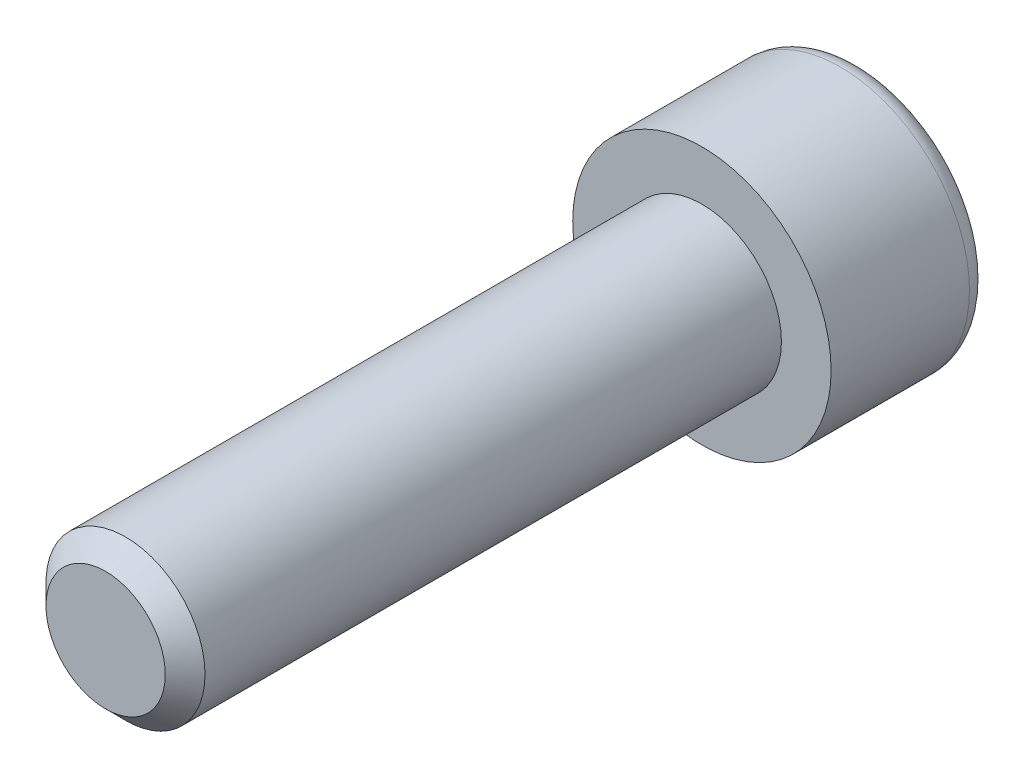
ISO-10303-21;
HEADER;
FILE_DESCRIPTION(('STEP AP214'),'2;1');
FILE_NAME('part.step','',(''),(''),'','','');
FILE_SCHEMA(('AUTOMOTIVE_DESIGN { 1 0 10303 214 1 1 1 1 }'));
ENDSEC;
DATA;
#1=APPLICATION_CONTEXT('core data for automotive mechanical design processes');
#2=APPLICATION_PROTOCOL_DEFINITION('international standard','automotive_design',2000,#1);
#3=PRODUCT_CONTEXT('',#1,'mechanical');
#4=PRODUCT('Part','Part','',(#3));
#5=PRODUCT_RELATED_PRODUCT_CATEGORY('part','',(#4));
#6=PRODUCT_DEFINITION_FORMATION('','',#4);
#7=PRODUCT_DEFINITION_CONTEXT('part definition',#1,'design');
#8=PRODUCT_DEFINITION('design','',#6,#7);
#9=PRODUCT_DEFINITION_SHAPE('','',#8);
#10=(LENGTH_UNIT() NAMED_UNIT(*) SI_UNIT(.MILLI.,.METRE.));
#11=(NAMED_UNIT(*) PLANE_ANGLE_UNIT() SI_UNIT($,.RADIAN.));
#12=(NAMED_UNIT(*) SI_UNIT($,.STERADIAN.) SOLID_ANGLE_UNIT());
#13=UNCERTAINTY_MEASURE_WITH_UNIT(LENGTH_MEASURE(1.E-05),#10,'distance_accuracy_value','');
#14=(GEOMETRIC_REPRESENTATION_CONTEXT(3) GLOBAL_UNCERTAINTY_ASSIGNED_CONTEXT((#13)) GLOBAL_UNIT_ASSIGNED_CONTEXT((#10,
#11,#12)) REPRESENTATION_CONTEXT('',''));
#15=CARTESIAN_POINT('',(0.,0.,0.));
#16=DIRECTION('',(0.,0.,1.));
#17=DIRECTION('',(1.,0.,0.));
#18=AXIS2_PLACEMENT_3D('',#15,#16,#17);
#19=CARTESIAN_POINT('',(0.,0.,-8.));
#20=DIRECTION('',(0.,0.,1.));
#21=DIRECTION('',(1.,0.,0.));
#22=AXIS2_PLACEMENT_3D('',#19,#20,#21);
#23=PLANE('',#22);
#24=CARTESIAN_POINT('',(0.,0.,-8.));
#25=DIRECTION('',(0.,0.,1.));
#26=DIRECTION('',(1.,0.,0.));
#27=AXIS2_PLACEMENT_3D('',#24,#25,#26);
#28=CIRCLE('',#27,5.46);
#29=CARTESIAN_POINT('',(5.46,0.,-8.));
#30=VERTEX_POINT('',#29);
#31=EDGE_CURVE('E11',#30,#30,#28,.F.);
#32=ORIENTED_EDGE('',*,*,#31,.T.);
#33=EDGE_LOOP('',(#32));
#34=FACE_BOUND('',#33,.T.);
#35=DIRECTION('',(0.866025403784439,-0.5,0.));
#36=VECTOR('',#35,1.);
#37=CARTESIAN_POINT('',(-3.,-1.73205080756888,-8.));
#38=LINE('',#37,#36);
#39=CARTESIAN_POINT('',(-3.,-1.73205080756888,-8.));
#40=VERTEX_POINT('',#39);
#41=CARTESIAN_POINT('',(0.,-3.46410161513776,-8.));
#42=VERTEX_POINT('',#41);
#43=EDGE_CURVE('E54',#40,#42,#38,.T.);
#44=ORIENTED_EDGE('',*,*,#43,.T.);
#45=DIRECTION('',(0.866025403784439,0.5,0.));
#46=VECTOR('',#45,1.);
#47=CARTESIAN_POINT('',(0.,-3.46410161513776,-8.));
#48=LINE('',#47,#46);
#49=CARTESIAN_POINT('',(3.,-1.73205080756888,-8.));
#50=VERTEX_POINT('',#49);
#51=EDGE_CURVE('E125',#42,#50,#48,.T.);
#52=ORIENTED_EDGE('',*,*,#51,.T.);
#53=DIRECTION('',(0.,1.,0.));
#54=VECTOR('',#53,1.);
#55=CARTESIAN_POINT('',(3.,-1.73205080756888,-8.));
#56=LINE('',#55,#54);
#57=CARTESIAN_POINT('',(3.,1.73205080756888,-8.));
#58=VERTEX_POINT('',#57);
#59=EDGE_CURVE('E128',#50,#58,#56,.T.);
#60=ORIENTED_EDGE('',*,*,#59,.T.);
#61=DIRECTION('',(-0.866025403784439,0.5,0.));
#62=VECTOR('',#61,1.);
#63=CARTESIAN_POINT('',(3.,1.73205080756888,-8.));
#64=LINE('',#63,#62);
#65=CARTESIAN_POINT('',(0.,3.46410161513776,-8.));
#66=VERTEX_POINT('',#65);
#67=EDGE_CURVE('E131',#58,#66,#64,.T.);
#68=ORIENTED_EDGE('',*,*,#67,.T.);
#69=DIRECTION('',(-0.866025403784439,-0.5,0.));
#70=VECTOR('',#69,1.);
#71=CARTESIAN_POINT('',(0.,3.46410161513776,-8.));
#72=LINE('',#71,#70);
#73=CARTESIAN_POINT('',(-3.,1.73205080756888,-8.));
#74=VERTEX_POINT('',#73);
#75=EDGE_CURVE('E115',#66,#74,#72,.T.);
#76=ORIENTED_EDGE('',*,*,#75,.T.);
#77=DIRECTION('',(0.,-1.,0.));
#78=VECTOR('',#77,1.);
#79=CARTESIAN_POINT('',(-3.,1.73205080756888,-8.));
#80=LINE('',#79,#78);
#81=EDGE_CURVE('E134',#74,#40,#80,.T.);
#82=ORIENTED_EDGE('',*,*,#81,.T.);
#83=EDGE_LOOP('',(#44,#52,#60,#68,#76,#82));
#84=FACE_BOUND('',#83,.T.);
#85=ADVANCED_FACE('F39',(#34,#84),#23,.F.);
#86=CARTESIAN_POINT('',(0.,0.,30.));
#87=DIRECTION('',(0.,0.,-1.));
#88=DIRECTION('',(-1.,0.,0.));
#89=AXIS2_PLACEMENT_3D('',#86,#87,#88);
#90=CYLINDRICAL_SURFACE('',#89,4.);
#91=CARTESIAN_POINT('',(0.,0.,29.));
#92=DIRECTION('',(0.,0.,1.));
#93=DIRECTION('',(1.,0.,0.));
#94=AXIS2_PLACEMENT_3D('',#91,#92,#93);
#95=CIRCLE('',#94,4.);
#96=CARTESIAN_POINT('',(4.,0.,29.));
#97=VERTEX_POINT('',#96);
#98=EDGE_CURVE('E154',#97,#97,#95,.F.);
#99=ORIENTED_EDGE('',*,*,#98,.T.);
#100=EDGE_LOOP('',(#99));
#101=FACE_BOUND('',#100,.T.);
#102=CARTESIAN_POINT('',(0.,0.,0.));
#103=DIRECTION('',(0.,0.,1.));
#104=DIRECTION('',(1.,0.,0.));
#105=AXIS2_PLACEMENT_3D('',#102,#103,#104);
#106=CIRCLE('',#105,4.);
#107=CARTESIAN_POINT('',(4.,0.,0.));
#108=VERTEX_POINT('',#107);
#109=EDGE_CURVE('E148',#108,#108,#106,.T.);
#110=ORIENTED_EDGE('',*,*,#109,.T.);
#111=EDGE_LOOP('',(#110));
#112=FACE_BOUND('',#111,.T.);
#113=ADVANCED_FACE('F171',(#101,#112),#90,.T.);
#114=CARTESIAN_POINT('',(0.,0.,30.));
#115=DIRECTION('',(0.,0.,1.));
#116=DIRECTION('',(1.,0.,0.));
#117=AXIS2_PLACEMENT_3D('',#114,#115,#116);
#118=PLANE('',#117);
#119=CARTESIAN_POINT('',(0.,0.,30.));
#120=DIRECTION('',(0.,0.,1.));
#121=DIRECTION('',(1.,0.,0.));
#122=AXIS2_PLACEMENT_3D('',#119,#120,#121);
#123=CIRCLE('',#122,3.);
#124=CARTESIAN_POINT('',(3.,0.,30.));
#125=VERTEX_POINT('',#124);
#126=EDGE_CURVE('E151',#125,#125,#123,.T.);
#127=ORIENTED_EDGE('',*,*,#126,.T.);
#128=EDGE_LOOP('',(#127));
#129=FACE_BOUND('',#128,.T.);
#130=ADVANCED_FACE('F177',(#129),#118,.T.);
#131=CARTESIAN_POINT('',(0.,0.,0.));
#132=DIRECTION('',(0.,0.,1.));
#133=DIRECTION('',(1.,0.,0.));
#134=AXIS2_PLACEMENT_3D('',#131,#132,#133);
#135=PLANE('',#134);
#136=CARTESIAN_POINT('',(0.,0.,0.));
#137=DIRECTION('',(0.,0.,1.));
#138=DIRECTION('',(1.,0.,0.));
#139=AXIS2_PLACEMENT_3D('',#136,#137,#138);
#140=CIRCLE('',#139,6.5);
#141=CARTESIAN_POINT('',(6.5,0.,0.));
#142=VERTEX_POINT('',#141);
#143=EDGE_CURVE('E145',#142,#142,#140,.T.);
#144=ORIENTED_EDGE('',*,*,#143,.T.);
#145=EDGE_LOOP('',(#144));
#146=FACE_BOUND('',#145,.T.);
#147=ORIENTED_EDGE('',*,*,#109,.F.);
#148=EDGE_LOOP('',(#147));
#149=FACE_BOUND('',#148,.T.);
#150=ADVANCED_FACE('F185',(#146,#149),#135,.T.);
#151=CARTESIAN_POINT('',(0.,0.,-8.));
#152=DIRECTION('',(0.,0.,1.));
#153=DIRECTION('',(1.,0.,0.));
#154=AXIS2_PLACEMENT_3D('',#151,#152,#153);
#155=CYLINDRICAL_SURFACE('',#154,6.5);
#156=CARTESIAN_POINT('',(0.,0.,-6.96));
#157=DIRECTION('',(0.,0.,1.));
#158=DIRECTION('',(1.,0.,0.));
#159=AXIS2_PLACEMENT_3D('',#156,#157,#158);
#160=CIRCLE('',#159,6.5);
#161=CARTESIAN_POINT('',(6.5,0.,-6.96));
#162=VERTEX_POINT('',#161);
#163=EDGE_CURVE('E47',#162,#162,#160,.T.);
#164=ORIENTED_EDGE('',*,*,#163,.T.);
#165=EDGE_LOOP('',(#164));
#166=FACE_BOUND('',#165,.T.);
#167=ORIENTED_EDGE('',*,*,#143,.F.);
#168=EDGE_LOOP('',(#167));
#169=FACE_BOUND('',#168,.T.);
#170=ADVANCED_FACE('F159',(#166,#169),#155,.T.);
#171=CARTESIAN_POINT('',(-3.,-1.73205080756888,-2.4));
#172=DIRECTION('',(0.5,0.866025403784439,0.));
#173=DIRECTION('',(-0.866025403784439,0.5,0.));
#174=AXIS2_PLACEMENT_3D('',#171,#172,#173);
#175=PLANE('',#174);
#176=ORIENTED_EDGE('',*,*,#43,.F.);
#177=DIRECTION('',(0.,0.,-1.));
#178=VECTOR('',#177,1.);
#179=CARTESIAN_POINT('',(-3.,-1.73205080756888,-2.4));
#180=LINE('',#179,#178);
#181=CARTESIAN_POINT('',(-3.,-1.73205080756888,-2.4));
#182=VERTEX_POINT('',#181);
#183=EDGE_CURVE('E120',#182,#40,#180,.T.);
#184=ORIENTED_EDGE('',*,*,#183,.F.);
#185=DIRECTION('',(0.866025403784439,-0.5,0.));
#186=VECTOR('',#185,1.);
#187=CARTESIAN_POINT('',(-3.,-1.73205080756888,-2.4));
#188=LINE('',#187,#186);
#189=CARTESIAN_POINT('',(0.,-3.46410161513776,-2.4));
#190=VERTEX_POINT('',#189);
#191=EDGE_CURVE('E137',#182,#190,#188,.T.);
#192=ORIENTED_EDGE('',*,*,#191,.T.);
#193=DIRECTION('',(0.,0.,-1.));
#194=VECTOR('',#193,1.);
#195=CARTESIAN_POINT('',(0.,-3.46410161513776,-2.4));
#196=LINE('',#195,#194);
#197=EDGE_CURVE('E143',#190,#42,#196,.T.);
#198=ORIENTED_EDGE('',*,*,#197,.T.);
#199=EDGE_LOOP('',(#176,#184,#192,#198));
#200=FACE_BOUND('',#199,.T.);
#201=ADVANCED_FACE('F183',(#200),#175,.T.);
#202=CARTESIAN_POINT('',(0.,-3.46410161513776,-2.4));
#203=DIRECTION('',(-0.5,0.866025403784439,0.));
#204=DIRECTION('',(-0.866025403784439,-0.5,0.));
#205=AXIS2_PLACEMENT_3D('',#202,#203,#204);
#206=PLANE('',#205);
#207=ORIENTED_EDGE('',*,*,#51,.F.);
#208=ORIENTED_EDGE('',*,*,#197,.F.);
#209=DIRECTION('',(0.866025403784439,0.5,0.));
#210=VECTOR('',#209,1.);
#211=CARTESIAN_POINT('',(0.,-3.46410161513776,-2.4));
#212=LINE('',#211,#210);
#213=CARTESIAN_POINT('',(3.,-1.73205080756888,-2.4));
#214=VERTEX_POINT('',#213);
#215=EDGE_CURVE('E93',#190,#214,#212,.T.);
#216=ORIENTED_EDGE('',*,*,#215,.T.);
#217=DIRECTION('',(0.,0.,-1.));
#218=VECTOR('',#217,1.);
#219=CARTESIAN_POINT('',(3.,-1.73205080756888,-2.4));
#220=LINE('',#219,#218);
#221=EDGE_CURVE('E141',#214,#50,#220,.T.);
#222=ORIENTED_EDGE('',*,*,#221,.T.);
#223=EDGE_LOOP('',(#207,#208,#216,#222));
#224=FACE_BOUND('',#223,.T.);
#225=ADVANCED_FACE('F215',(#224),#206,.T.);
#226=CARTESIAN_POINT('',(3.,-1.73205080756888,-2.4));
#227=DIRECTION('',(-1.,0.,0.));
#228=DIRECTION('',(0.,-1.,0.));
#229=AXIS2_PLACEMENT_3D('',#226,#227,#228);
#230=PLANE('',#229);
#231=ORIENTED_EDGE('',*,*,#59,.F.);
#232=ORIENTED_EDGE('',*,*,#221,.F.);
#233=DIRECTION('',(0.,1.,0.));
#234=VECTOR('',#233,1.);
#235=CARTESIAN_POINT('',(3.,-1.73205080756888,-2.4));
#236=LINE('',#235,#234);
#237=CARTESIAN_POINT('',(3.,1.73205080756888,-2.4));
#238=VERTEX_POINT('',#237);
#239=EDGE_CURVE('E111',#214,#238,#236,.T.);
#240=ORIENTED_EDGE('',*,*,#239,.T.);
#241=DIRECTION('',(0.,0.,-1.));
#242=VECTOR('',#241,1.);
#243=CARTESIAN_POINT('',(3.,1.73205080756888,-2.4));
#244=LINE('',#243,#242);
#245=EDGE_CURVE('E108',#238,#58,#244,.T.);
#246=ORIENTED_EDGE('',*,*,#245,.T.);
#247=EDGE_LOOP('',(#231,#232,#240,#246));
#248=FACE_BOUND('',#247,.T.);
#249=ADVANCED_FACE('F221',(#248),#230,.T.);
#250=CARTESIAN_POINT('',(3.,1.73205080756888,-2.4));
#251=DIRECTION('',(-0.5,-0.866025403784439,0.));
#252=DIRECTION('',(0.866025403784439,-0.5,0.));
#253=AXIS2_PLACEMENT_3D('',#250,#251,#252);
#254=PLANE('',#253);
#255=ORIENTED_EDGE('',*,*,#67,.F.);
#256=ORIENTED_EDGE('',*,*,#245,.F.);
#257=DIRECTION('',(-0.866025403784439,0.5,0.));
#258=VECTOR('',#257,1.);
#259=CARTESIAN_POINT('',(3.,1.73205080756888,-2.4));
#260=LINE('',#259,#258);
#261=CARTESIAN_POINT('',(0.,3.46410161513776,-2.4));
#262=VERTEX_POINT('',#261);
#263=EDGE_CURVE('E103',#238,#262,#260,.T.);
#264=ORIENTED_EDGE('',*,*,#263,.T.);
#265=DIRECTION('',(0.,0.,-1.));
#266=VECTOR('',#265,1.);
#267=CARTESIAN_POINT('',(0.,3.46410161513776,-2.4));
#268=LINE('',#267,#266);
#269=EDGE_CURVE('E107',#262,#66,#268,.T.);
#270=ORIENTED_EDGE('',*,*,#269,.T.);
#271=EDGE_LOOP('',(#255,#256,#264,#270));
#272=FACE_BOUND('',#271,.T.);
#273=ADVANCED_FACE('F106',(#272),#254,.T.);
#274=CARTESIAN_POINT('',(0.,3.46410161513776,-2.4));
#275=DIRECTION('',(0.5,-0.866025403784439,0.));
#276=DIRECTION('',(0.866025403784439,0.5,0.));
#277=AXIS2_PLACEMENT_3D('',#274,#275,#276);
#278=PLANE('',#277);
#279=ORIENTED_EDGE('',*,*,#75,.F.);
#280=ORIENTED_EDGE('',*,*,#269,.F.);
#281=DIRECTION('',(-0.866025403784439,-0.5,0.));
#282=VECTOR('',#281,1.);
#283=CARTESIAN_POINT('',(0.,3.46410161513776,-2.4));
#284=LINE('',#283,#282);
#285=CARTESIAN_POINT('',(-3.,1.73205080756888,-2.4));
#286=VERTEX_POINT('',#285);
#287=EDGE_CURVE('E110',#262,#286,#284,.T.);
#288=ORIENTED_EDGE('',*,*,#287,.T.);
#289=DIRECTION('',(0.,0.,-1.));
#290=VECTOR('',#289,1.);
#291=CARTESIAN_POINT('',(-3.,1.73205080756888,-2.4));
#292=LINE('',#291,#290);
#293=EDGE_CURVE('E84',#286,#74,#292,.T.);
#294=ORIENTED_EDGE('',*,*,#293,.T.);
#295=EDGE_LOOP('',(#279,#280,#288,#294));
#296=FACE_BOUND('',#295,.T.);
#297=ADVANCED_FACE('F113',(#296),#278,.T.);
#298=CARTESIAN_POINT('',(-3.,1.73205080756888,-2.4));
#299=DIRECTION('',(1.,0.,0.));
#300=DIRECTION('',(0.,1.,0.));
#301=AXIS2_PLACEMENT_3D('',#298,#299,#300);
#302=PLANE('',#301);
#303=ORIENTED_EDGE('',*,*,#81,.F.);
#304=ORIENTED_EDGE('',*,*,#293,.F.);
#305=DIRECTION('',(0.,-1.,0.));
#306=VECTOR('',#305,1.);
#307=CARTESIAN_POINT('',(-3.,1.73205080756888,-2.4));
#308=LINE('',#307,#306);
#309=EDGE_CURVE('E62',#286,#182,#308,.T.);
#310=ORIENTED_EDGE('',*,*,#309,.T.);
#311=ORIENTED_EDGE('',*,*,#183,.T.);
#312=EDGE_LOOP('',(#303,#304,#310,#311));
#313=FACE_BOUND('',#312,.T.);
#314=ADVANCED_FACE('F241',(#313),#302,.T.);
#315=CARTESIAN_POINT('',(-6.,0.,-2.4));
#316=DIRECTION('',(0.,0.,-1.));
#317=DIRECTION('',(-1.,0.,0.));
#318=AXIS2_PLACEMENT_3D('',#315,#316,#317);
#319=PLANE('',#318);
#320=ORIENTED_EDGE('',*,*,#191,.F.);
#321=ORIENTED_EDGE('',*,*,#309,.F.);
#322=ORIENTED_EDGE('',*,*,#287,.F.);
#323=ORIENTED_EDGE('',*,*,#263,.F.);
#324=ORIENTED_EDGE('',*,*,#239,.F.);
#325=ORIENTED_EDGE('',*,*,#215,.F.);
#326=EDGE_LOOP('',(#320,#321,#322,#323,#324,#325));
#327=FACE_BOUND('',#326,.T.);
#328=ADVANCED_FACE('F118',(#327),#319,.T.);
#329=CARTESIAN_POINT('',(0.,0.,30.));
#330=DIRECTION('',(0.,0.,-1.));
#331=DIRECTION('',(-1.,0.,0.));
#332=AXIS2_PLACEMENT_3D('',#329,#330,#331);
#333=CONICAL_SURFACE('',#332,3.,0.785398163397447);
#334=ORIENTED_EDGE('',*,*,#98,.F.);
#335=EDGE_LOOP('',(#334));
#336=FACE_BOUND('',#335,.T.);
#337=ORIENTED_EDGE('',*,*,#126,.F.);
#338=EDGE_LOOP('',(#337));
#339=FACE_BOUND('',#338,.T.);
#340=ADVANCED_FACE('F163',(#336,#339),#333,.T.);
#341=CARTESIAN_POINT('',(0.,0.,-6.96));
#342=DIRECTION('',(0.,0.,1.));
#343=DIRECTION('',(1.,0.,0.));
#344=AXIS2_PLACEMENT_3D('',#341,#342,#343);
#345=TOROIDAL_SURFACE('',#344,5.46,1.04);
#346=ORIENTED_EDGE('',*,*,#31,.F.);
#347=EDGE_LOOP('',(#346));
#348=FACE_BOUND('',#347,.T.);
#349=ORIENTED_EDGE('',*,*,#163,.F.);
#350=EDGE_LOOP('',(#349));
#351=FACE_BOUND('',#350,.T.);
#352=ADVANCED_FACE('F41',(#348,#351),#345,.T.);
#353=CLOSED_SHELL('',(#85,#113,#130,#150,#170,#201,#225,#249,#273,#297,#314,#328,#340,#352));
#354=MANIFOLD_SOLID_BREP('B2',#353);
#355=ADVANCED_BREP_SHAPE_REPRESENTATION('',(#18,#354),#14);
#356=SHAPE_DEFINITION_REPRESENTATION(#9,#355);
ENDSEC;
END-ISO-10303-21;
